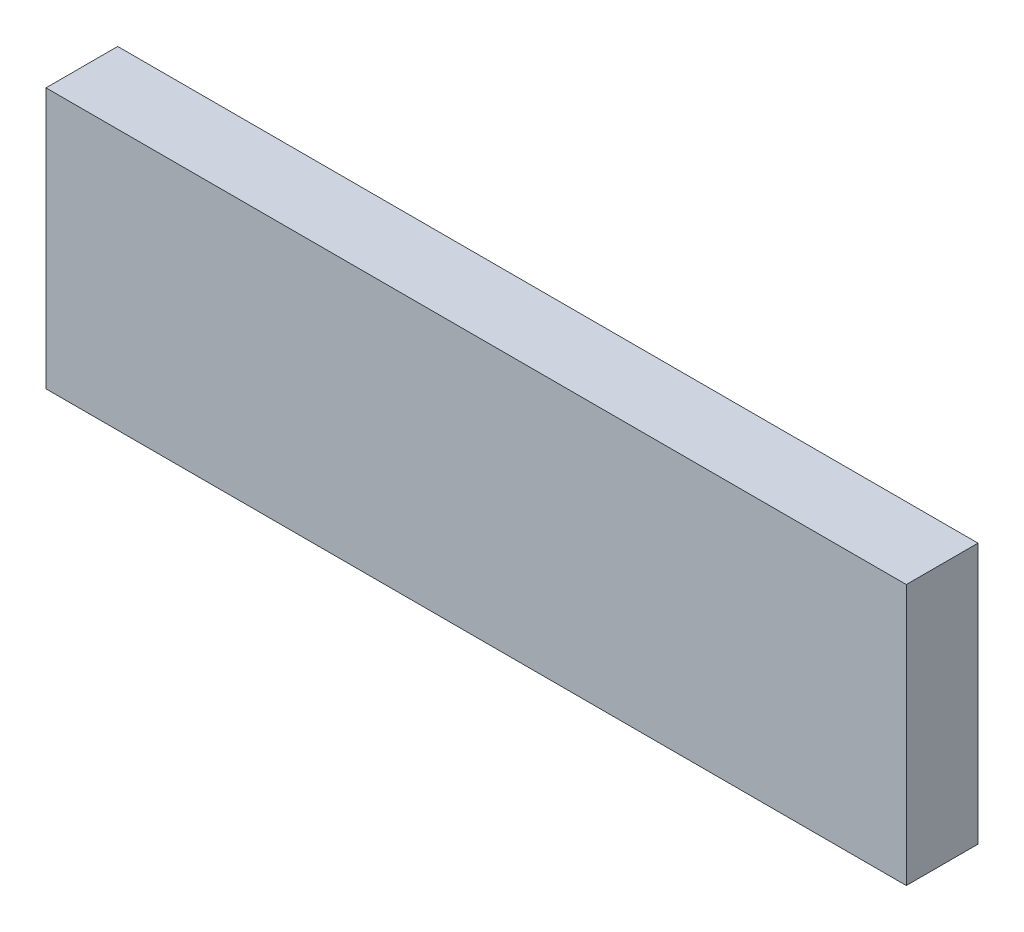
from build123d import *

# Parameters (mm, degrees)
SKETCH1_W           = 66
SKETCH1_H           = 20
BOSS_EXTRUDE1_DEPTH = 5.5


with BuildPart() as part:
    # Sketch1 → Boss-Extrude1 (new body)
    with BuildSketch(Plane.XY):
        with Locations((33, 10)):
            Rectangle(SKETCH1_W, SKETCH1_H)
    extrude(amount=BOSS_EXTRUDE1_DEPTH)


solid = part.part
